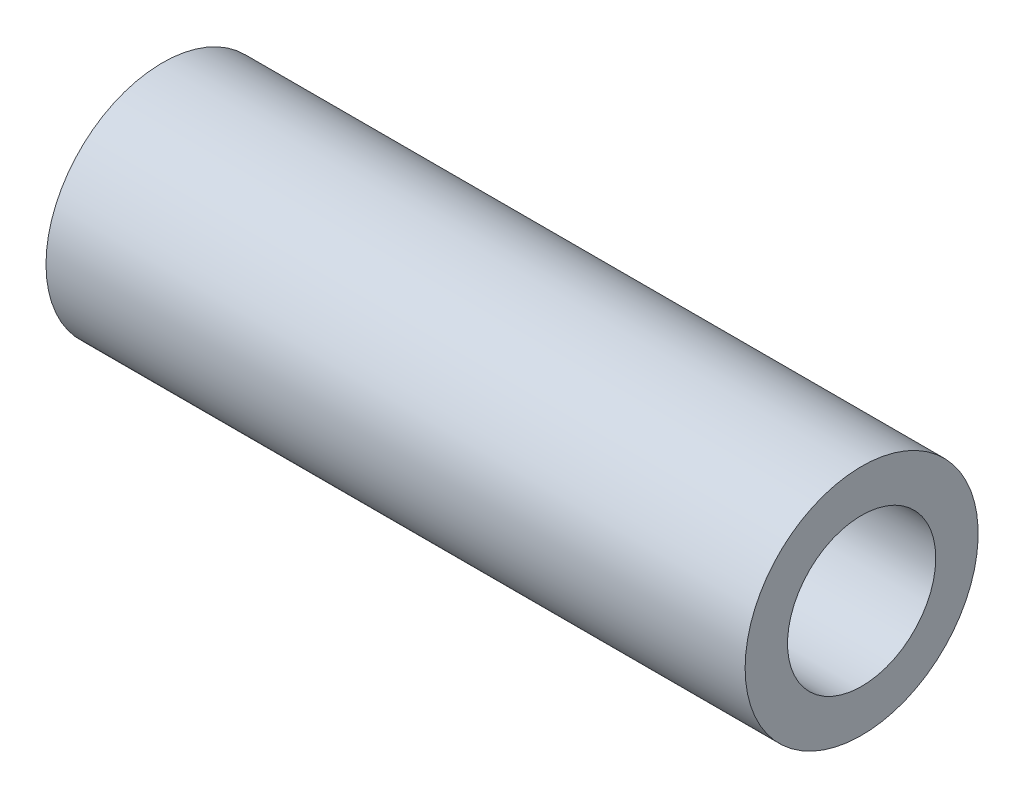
ISO-10303-21;
HEADER;
FILE_DESCRIPTION(('STEP AP214'),'2;1');
FILE_NAME('part.step','',(''),(''),'','','');
FILE_SCHEMA(('AUTOMOTIVE_DESIGN { 1 0 10303 214 1 1 1 1 }'));
ENDSEC;
DATA;
#1=APPLICATION_CONTEXT('core data for automotive mechanical design processes');
#2=APPLICATION_PROTOCOL_DEFINITION('international standard','automotive_design',2000,#1);
#3=PRODUCT_CONTEXT('',#1,'mechanical');
#4=PRODUCT('Part','Part','',(#3));
#5=PRODUCT_RELATED_PRODUCT_CATEGORY('part','',(#4));
#6=PRODUCT_DEFINITION_FORMATION('','',#4);
#7=PRODUCT_DEFINITION_CONTEXT('part definition',#1,'design');
#8=PRODUCT_DEFINITION('design','',#6,#7);
#9=PRODUCT_DEFINITION_SHAPE('','',#8);
#10=(LENGTH_UNIT() NAMED_UNIT(*) SI_UNIT(.MILLI.,.METRE.));
#11=(NAMED_UNIT(*) PLANE_ANGLE_UNIT() SI_UNIT($,.RADIAN.));
#12=(NAMED_UNIT(*) SI_UNIT($,.STERADIAN.) SOLID_ANGLE_UNIT());
#13=UNCERTAINTY_MEASURE_WITH_UNIT(LENGTH_MEASURE(1.E-05),#10,'distance_accuracy_value','');
#14=(GEOMETRIC_REPRESENTATION_CONTEXT(3) GLOBAL_UNCERTAINTY_ASSIGNED_CONTEXT((#13)) GLOBAL_UNIT_ASSIGNED_CONTEXT((#10,
#11,#12)) REPRESENTATION_CONTEXT('',''));
#15=CARTESIAN_POINT('',(0.,0.,0.));
#16=DIRECTION('',(0.,0.,1.));
#17=DIRECTION('',(1.,0.,0.));
#18=AXIS2_PLACEMENT_3D('',#15,#16,#17);
#19=CARTESIAN_POINT('',(9.525,0.,0.));
#20=DIRECTION('',(-1.,0.,0.));
#21=DIRECTION('',(0.,0.,1.));
#22=AXIS2_PLACEMENT_3D('',#19,#20,#21);
#23=CYLINDRICAL_SURFACE('',#22,3.175);
#24=CARTESIAN_POINT('',(9.525,0.,0.));
#25=DIRECTION('',(1.,0.,0.));
#26=DIRECTION('',(0.,0.,-1.));
#27=AXIS2_PLACEMENT_3D('',#24,#25,#26);
#28=CIRCLE('',#27,3.175);
#29=CARTESIAN_POINT('',(9.525,0.,3.175));
#30=VERTEX_POINT('',#29);
#31=EDGE_CURVE('E10',#30,#30,#28,.T.);
#32=CARTESIAN_POINT('',(-9.525,0.,0.));
#33=DIRECTION('',(1.,0.,0.));
#34=DIRECTION('',(0.,0.,-1.));
#35=AXIS2_PLACEMENT_3D('',#32,#33,#34);
#36=CIRCLE('',#35,3.175);
#37=CARTESIAN_POINT('',(-9.525,0.,3.175));
#38=VERTEX_POINT('',#37);
#39=EDGE_CURVE('E37',#38,#38,#36,.T.);
#40=CARTESIAN_POINT('',(9.525,0.,3.175));
#41=CARTESIAN_POINT('',(9.3265625,0.,3.175));
#42=CARTESIAN_POINT('',(9.128125,0.,3.175));
#43=CARTESIAN_POINT('',(8.73125,0.,3.175));
#44=CARTESIAN_POINT('',(8.5328125,0.,3.175));
#45=CARTESIAN_POINT('',(8.1359375,0.,3.175));
#46=CARTESIAN_POINT('',(7.9375,0.,3.175));
#47=CARTESIAN_POINT('',(7.540625,0.,3.175));
#48=CARTESIAN_POINT('',(7.3421875,0.,3.175));
#49=CARTESIAN_POINT('',(6.9453125,0.,3.175));
#50=CARTESIAN_POINT('',(6.746875,0.,3.175));
#51=CARTESIAN_POINT('',(6.35,0.,3.175));
#52=CARTESIAN_POINT('',(6.1515625,0.,3.175));
#53=CARTESIAN_POINT('',(5.7546875,0.,3.175));
#54=CARTESIAN_POINT('',(5.55625,0.,3.175));
#55=CARTESIAN_POINT('',(5.159375,0.,3.175));
#56=CARTESIAN_POINT('',(4.9609375,0.,3.175));
#57=CARTESIAN_POINT('',(4.5640625,0.,3.175));
#58=CARTESIAN_POINT('',(4.365625,0.,3.175));
#59=CARTESIAN_POINT('',(3.96875,0.,3.175));
#60=CARTESIAN_POINT('',(3.7703125,0.,3.175));
#61=CARTESIAN_POINT('',(3.3734375,0.,3.175));
#62=CARTESIAN_POINT('',(3.175,0.,3.175));
#63=CARTESIAN_POINT('',(2.778125,0.,3.175));
#64=CARTESIAN_POINT('',(2.5796875,0.,3.175));
#65=CARTESIAN_POINT('',(2.1828125,0.,3.175));
#66=CARTESIAN_POINT('',(1.984375,0.,3.175));
#67=CARTESIAN_POINT('',(1.5875,0.,3.175));
#68=CARTESIAN_POINT('',(1.3890625,0.,3.175));
#69=CARTESIAN_POINT('',(0.992187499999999,0.,3.175));
#70=CARTESIAN_POINT('',(0.793749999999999,0.,3.175));
#71=CARTESIAN_POINT('',(0.396874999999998,0.,3.175));
#72=CARTESIAN_POINT('',(0.198437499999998,0.,3.175));
#73=CARTESIAN_POINT('',(-0.198437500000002,0.,3.175));
#74=CARTESIAN_POINT('',(-0.396875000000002,0.,3.175));
#75=CARTESIAN_POINT('',(-0.793750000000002,0.,3.175));
#76=CARTESIAN_POINT('',(-0.992187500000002,0.,3.175));
#77=CARTESIAN_POINT('',(-1.3890625,0.,3.175));
#78=CARTESIAN_POINT('',(-1.5875,0.,3.175));
#79=CARTESIAN_POINT('',(-1.984375,0.,3.175));
#80=CARTESIAN_POINT('',(-2.1828125,0.,3.175));
#81=CARTESIAN_POINT('',(-2.5796875,0.,3.175));
#82=CARTESIAN_POINT('',(-2.778125,0.,3.175));
#83=CARTESIAN_POINT('',(-3.175,0.,3.175));
#84=CARTESIAN_POINT('',(-3.3734375,0.,3.175));
#85=CARTESIAN_POINT('',(-3.7703125,0.,3.175));
#86=CARTESIAN_POINT('',(-3.96875,0.,3.175));
#87=CARTESIAN_POINT('',(-4.365625,0.,3.175));
#88=CARTESIAN_POINT('',(-4.5640625,0.,3.175));
#89=CARTESIAN_POINT('',(-4.9609375,0.,3.175));
#90=CARTESIAN_POINT('',(-5.159375,0.,3.175));
#91=CARTESIAN_POINT('',(-5.55625,0.,3.175));
#92=CARTESIAN_POINT('',(-5.7546875,0.,3.175));
#93=CARTESIAN_POINT('',(-6.1515625,0.,3.175));
#94=CARTESIAN_POINT('',(-6.35,0.,3.175));
#95=CARTESIAN_POINT('',(-6.746875,0.,3.175));
#96=CARTESIAN_POINT('',(-6.9453125,0.,3.175));
#97=CARTESIAN_POINT('',(-7.3421875,0.,3.175));
#98=CARTESIAN_POINT('',(-7.540625,0.,3.175));
#99=CARTESIAN_POINT('',(-7.9375,0.,3.175));
#100=CARTESIAN_POINT('',(-8.1359375,0.,3.175));
#101=CARTESIAN_POINT('',(-8.5328125,0.,3.175));
#102=CARTESIAN_POINT('',(-8.73125,0.,3.175));
#103=CARTESIAN_POINT('',(-9.128125,0.,3.175));
#104=CARTESIAN_POINT('',(-9.3265625,0.,3.175));
#105=CARTESIAN_POINT('',(-9.525,0.,3.175));
#106=B_SPLINE_CURVE_WITH_KNOTS('',3,(#40,#41,#42,#43,#44,#45,#46,#47,#48,#49,#50,#51,#52,#53,
#54,#55,#56,#57,#58,#59,#60,#61,#62,#63,#64,#65,#66,#67,#68,#69,#70,#71,#72,#73,#74,#75,#76,#77,
#78,#79,#80,#81,#82,#83,#84,#85,#86,#87,#88,#89,#90,#91,#92,#93,#94,#95,#96,#97,#98,#99,#100,
#101,#102,#103,#104,#105),.UNSPECIFIED.,.F.,.F.,(4,2,2,2,2,2,2,2,2,2,2,2,2,2,2,2,2,2,2,2,2,2,2,
2,2,2,2,2,2,2,2,2,4),(0.,0.595312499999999,1.190625,1.7859375,2.38125,2.9765625,3.571875,
4.1671875,4.7625,5.3578125,5.953125,6.5484375,7.14375,7.7390625,8.334375,8.9296875,9.525,
10.1203125,10.715625,11.3109375,11.90625,12.5015625,13.096875,13.6921875,14.2875,14.8828125,
15.478125,16.0734375,16.66875,17.2640625,17.859375,18.4546875,19.05),.UNSPECIFIED.);
#107=EDGE_CURVE('BSEAM34',#30,#38,#106,.T.);
#108=ORIENTED_EDGE('',*,*,#31,.F.);
#109=ORIENTED_EDGE('',*,*,#39,.T.);
#110=ORIENTED_EDGE('',*,*,#107,.T.);
#111=ORIENTED_EDGE('',*,*,#107,.F.);
#112=EDGE_LOOP('',(#108,#110,#109,#111));
#113=FACE_BOUND('',#112,.T.);
#114=ADVANCED_FACE('F34',(#113),#23,.T.);
#115=CARTESIAN_POINT('',(9.525,0.,0.));
#116=DIRECTION('',(1.,0.,0.));
#117=DIRECTION('',(0.,0.,-1.));
#118=AXIS2_PLACEMENT_3D('',#115,#116,#117);
#119=PLANE('',#118);
#120=CARTESIAN_POINT('',(9.525,0.,0.));
#121=DIRECTION('',(1.,0.,0.));
#122=DIRECTION('',(0.,0.,-1.));
#123=AXIS2_PLACEMENT_3D('',#120,#121,#122);
#124=CIRCLE('',#123,2.0193);
#125=CARTESIAN_POINT('',(9.525,0.,-2.0193));
#126=VERTEX_POINT('',#125);
#127=EDGE_CURVE('E46',#126,#126,#124,.T.);
#128=ORIENTED_EDGE('',*,*,#127,.F.);
#129=EDGE_LOOP('',(#128));
#130=FACE_BOUND('',#129,.T.);
#131=ORIENTED_EDGE('',*,*,#31,.T.);
#132=EDGE_LOOP('',(#131));
#133=FACE_BOUND('',#132,.T.);
#134=ADVANCED_FACE('F61',(#130,#133),#119,.T.);
#135=CARTESIAN_POINT('',(-9.525,0.,0.));
#136=DIRECTION('',(1.,0.,0.));
#137=DIRECTION('',(0.,0.,-1.));
#138=AXIS2_PLACEMENT_3D('',#135,#136,#137);
#139=PLANE('',#138);
#140=CARTESIAN_POINT('',(-9.525,0.,0.));
#141=DIRECTION('',(1.,0.,0.));
#142=DIRECTION('',(0.,0.,-1.));
#143=AXIS2_PLACEMENT_3D('',#140,#141,#142);
#144=CIRCLE('',#143,2.0193);
#145=CARTESIAN_POINT('',(-9.525,0.,-2.0193));
#146=VERTEX_POINT('',#145);
#147=EDGE_CURVE('E44',#146,#146,#144,.T.);
#148=ORIENTED_EDGE('',*,*,#147,.T.);
#149=EDGE_LOOP('',(#148));
#150=FACE_BOUND('',#149,.T.);
#151=ORIENTED_EDGE('',*,*,#39,.F.);
#152=EDGE_LOOP('',(#151));
#153=FACE_BOUND('',#152,.T.);
#154=ADVANCED_FACE('F52',(#150,#153),#139,.F.);
#155=CARTESIAN_POINT('',(-9.525,0.,0.));
#156=DIRECTION('',(1.,0.,0.));
#157=DIRECTION('',(0.,0.,-1.));
#158=AXIS2_PLACEMENT_3D('',#155,#156,#157);
#159=CYLINDRICAL_SURFACE('',#158,2.0193);
#160=CARTESIAN_POINT('',(-9.525,0.,-2.0193));
#161=CARTESIAN_POINT('',(-9.3265625,0.,-2.0193));
#162=CARTESIAN_POINT('',(-9.128125,0.,-2.0193));
#163=CARTESIAN_POINT('',(-8.73125,0.,-2.0193));
#164=CARTESIAN_POINT('',(-8.5328125,0.,-2.0193));
#165=CARTESIAN_POINT('',(-8.1359375,0.,-2.0193));
#166=CARTESIAN_POINT('',(-7.9375,0.,-2.0193));
#167=CARTESIAN_POINT('',(-7.540625,0.,-2.0193));
#168=CARTESIAN_POINT('',(-7.3421875,0.,-2.0193));
#169=CARTESIAN_POINT('',(-6.9453125,0.,-2.0193));
#170=CARTESIAN_POINT('',(-6.746875,0.,-2.0193));
#171=CARTESIAN_POINT('',(-6.35,0.,-2.0193));
#172=CARTESIAN_POINT('',(-6.1515625,0.,-2.0193));
#173=CARTESIAN_POINT('',(-5.7546875,0.,-2.0193));
#174=CARTESIAN_POINT('',(-5.55625,0.,-2.0193));
#175=CARTESIAN_POINT('',(-5.159375,0.,-2.0193));
#176=CARTESIAN_POINT('',(-4.9609375,0.,-2.0193));
#177=CARTESIAN_POINT('',(-4.5640625,0.,-2.0193));
#178=CARTESIAN_POINT('',(-4.365625,0.,-2.0193));
#179=CARTESIAN_POINT('',(-3.96875,0.,-2.0193));
#180=CARTESIAN_POINT('',(-3.7703125,0.,-2.0193));
#181=CARTESIAN_POINT('',(-3.3734375,0.,-2.0193));
#182=CARTESIAN_POINT('',(-3.175,0.,-2.0193));
#183=CARTESIAN_POINT('',(-2.778125,0.,-2.0193));
#184=CARTESIAN_POINT('',(-2.5796875,0.,-2.0193));
#185=CARTESIAN_POINT('',(-2.1828125,0.,-2.0193));
#186=CARTESIAN_POINT('',(-1.984375,0.,-2.0193));
#187=CARTESIAN_POINT('',(-1.5875,0.,-2.0193));
#188=CARTESIAN_POINT('',(-1.3890625,0.,-2.0193));
#189=CARTESIAN_POINT('',(-0.992187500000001,0.,-2.0193));
#190=CARTESIAN_POINT('',(-0.793750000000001,0.,-2.0193));
#191=CARTESIAN_POINT('',(-0.396875,0.,-2.0193));
#192=CARTESIAN_POINT('',(-0.1984375,0.,-2.0193));
#193=CARTESIAN_POINT('',(0.1984375,0.,-2.0193));
#194=CARTESIAN_POINT('',(0.396875,0.,-2.0193));
#195=CARTESIAN_POINT('',(0.793750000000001,0.,-2.0193));
#196=CARTESIAN_POINT('',(0.992187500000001,0.,-2.0193));
#197=CARTESIAN_POINT('',(1.3890625,0.,-2.0193));
#198=CARTESIAN_POINT('',(1.5875,0.,-2.0193));
#199=CARTESIAN_POINT('',(1.984375,0.,-2.0193));
#200=CARTESIAN_POINT('',(2.1828125,0.,-2.0193));
#201=CARTESIAN_POINT('',(2.5796875,0.,-2.0193));
#202=CARTESIAN_POINT('',(2.778125,0.,-2.0193));
#203=CARTESIAN_POINT('',(3.175,0.,-2.0193));
#204=CARTESIAN_POINT('',(3.3734375,0.,-2.0193));
#205=CARTESIAN_POINT('',(3.7703125,0.,-2.0193));
#206=CARTESIAN_POINT('',(3.96875,0.,-2.0193));
#207=CARTESIAN_POINT('',(4.365625,0.,-2.0193));
#208=CARTESIAN_POINT('',(4.5640625,0.,-2.0193));
#209=CARTESIAN_POINT('',(4.9609375,0.,-2.0193));
#210=CARTESIAN_POINT('',(5.159375,0.,-2.0193));
#211=CARTESIAN_POINT('',(5.55625,0.,-2.0193));
#212=CARTESIAN_POINT('',(5.7546875,0.,-2.0193));
#213=CARTESIAN_POINT('',(6.1515625,0.,-2.0193));
#214=CARTESIAN_POINT('',(6.35,0.,-2.0193));
#215=CARTESIAN_POINT('',(6.746875,0.,-2.0193));
#216=CARTESIAN_POINT('',(6.9453125,0.,-2.0193));
#217=CARTESIAN_POINT('',(7.3421875,0.,-2.0193));
#218=CARTESIAN_POINT('',(7.540625,0.,-2.0193));
#219=CARTESIAN_POINT('',(7.9375,0.,-2.0193));
#220=CARTESIAN_POINT('',(8.1359375,0.,-2.0193));
#221=CARTESIAN_POINT('',(8.5328125,0.,-2.0193));
#222=CARTESIAN_POINT('',(8.73125,0.,-2.0193));
#223=CARTESIAN_POINT('',(9.128125,0.,-2.0193));
#224=CARTESIAN_POINT('',(9.3265625,0.,-2.0193));
#225=CARTESIAN_POINT('',(9.525,0.,-2.0193));
#226=B_SPLINE_CURVE_WITH_KNOTS('',3,(#160,#161,#162,#163,#164,#165,#166,#167,#168,#169,#170,
#171,#172,#173,#174,#175,#176,#177,#178,#179,#180,#181,#182,#183,#184,#185,#186,#187,#188,#189,
#190,#191,#192,#193,#194,#195,#196,#197,#198,#199,#200,#201,#202,#203,#204,#205,#206,#207,#208,
#209,#210,#211,#212,#213,#214,#215,#216,#217,#218,#219,#220,#221,#222,#223,#224,#225),
.UNSPECIFIED.,.F.,.F.,(4,2,2,2,2,2,2,2,2,2,2,2,2,2,2,2,2,2,2,2,2,2,2,2,2,2,2,2,2,2,2,2,4),(0.,
0.595312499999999,1.190625,1.7859375,2.38125,2.9765625,3.571875,4.1671875,4.7625,5.3578125,
5.953125,6.5484375,7.14375,7.7390625,8.334375,8.9296875,9.525,10.1203125,10.715625,11.3109375,
11.90625,12.5015625,13.096875,13.6921875,14.2875,14.8828125,15.478125,16.0734375,16.66875,
17.2640625,17.859375,18.4546875,19.05),.UNSPECIFIED.);
#227=EDGE_CURVE('BSEAM55',#146,#126,#226,.T.);
#228=ORIENTED_EDGE('',*,*,#147,.F.);
#229=ORIENTED_EDGE('',*,*,#127,.T.);
#230=ORIENTED_EDGE('',*,*,#227,.T.);
#231=ORIENTED_EDGE('',*,*,#227,.F.);
#232=EDGE_LOOP('',(#228,#230,#229,#231));
#233=FACE_BOUND('',#232,.T.);
#234=ADVANCED_FACE('F55',(#233),#159,.F.);
#235=CLOSED_SHELL('',(#114,#134,#154,#234));
#236=MANIFOLD_SOLID_BREP('B2',#235);
#237=ADVANCED_BREP_SHAPE_REPRESENTATION('',(#18,#236),#14);
#238=SHAPE_DEFINITION_REPRESENTATION(#9,#237);
ENDSEC;
END-ISO-10303-21;
